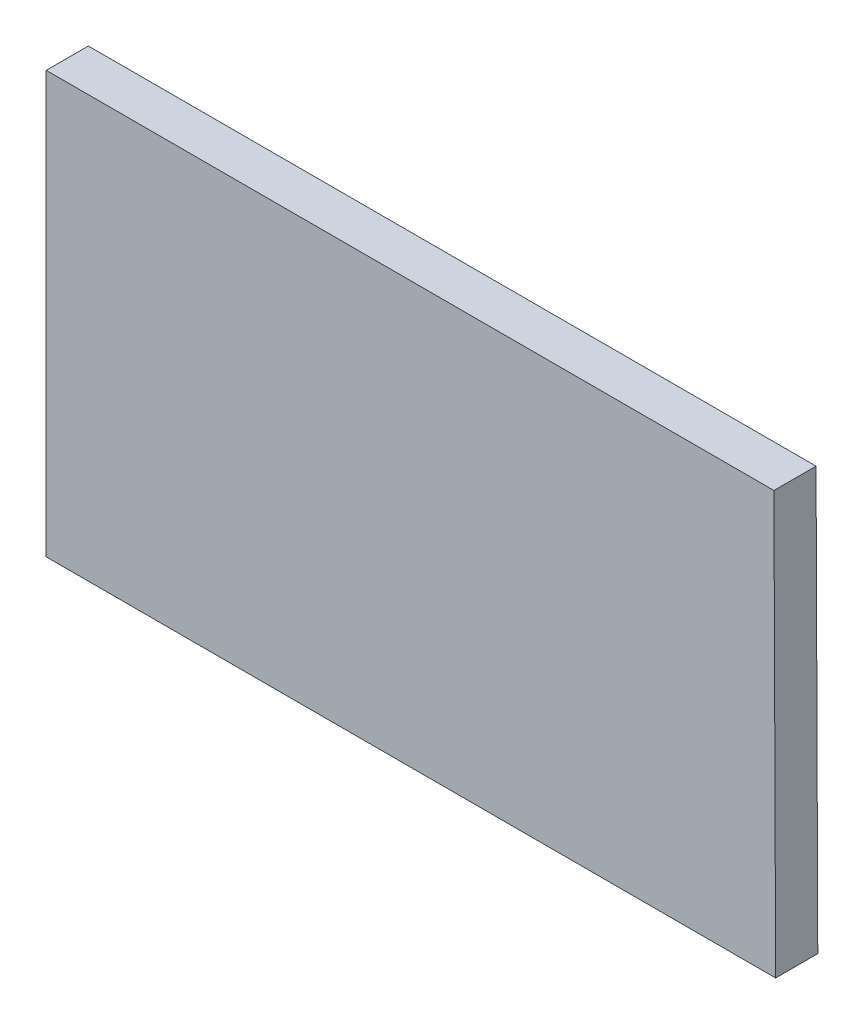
ISO-10303-21;
HEADER;
FILE_DESCRIPTION(('STEP AP214'),'2;1');
FILE_NAME('part.step','',(''),(''),'','','');
FILE_SCHEMA(('AUTOMOTIVE_DESIGN { 1 0 10303 214 1 1 1 1 }'));
ENDSEC;
DATA;
#1=APPLICATION_CONTEXT('core data for automotive mechanical design processes');
#2=APPLICATION_PROTOCOL_DEFINITION('international standard','automotive_design',2000,#1);
#3=PRODUCT_CONTEXT('',#1,'mechanical');
#4=PRODUCT('Part','Part','',(#3));
#5=PRODUCT_RELATED_PRODUCT_CATEGORY('part','',(#4));
#6=PRODUCT_DEFINITION_FORMATION('','',#4);
#7=PRODUCT_DEFINITION_CONTEXT('part definition',#1,'design');
#8=PRODUCT_DEFINITION('design','',#6,#7);
#9=PRODUCT_DEFINITION_SHAPE('','',#8);
#10=(LENGTH_UNIT() NAMED_UNIT(*) SI_UNIT(.MILLI.,.METRE.));
#11=(NAMED_UNIT(*) PLANE_ANGLE_UNIT() SI_UNIT($,.RADIAN.));
#12=(NAMED_UNIT(*) SI_UNIT($,.STERADIAN.) SOLID_ANGLE_UNIT());
#13=UNCERTAINTY_MEASURE_WITH_UNIT(LENGTH_MEASURE(1.E-05),#10,'distance_accuracy_value','');
#14=(GEOMETRIC_REPRESENTATION_CONTEXT(3) GLOBAL_UNCERTAINTY_ASSIGNED_CONTEXT((#13)) GLOBAL_UNIT_ASSIGNED_CONTEXT((#10,
#11,#12)) REPRESENTATION_CONTEXT('',''));
#15=CARTESIAN_POINT('',(0.,0.,0.));
#16=DIRECTION('',(0.,0.,1.));
#17=DIRECTION('',(1.,0.,0.));
#18=AXIS2_PLACEMENT_3D('',#15,#16,#17);
#19=CARTESIAN_POINT('',(-17.3115998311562,10.,2.));
#20=DIRECTION('',(1.,0.,0.));
#21=DIRECTION('',(0.,0.,-1.));
#22=AXIS2_PLACEMENT_3D('',#19,#20,#21);
#23=PLANE('',#22);
#24=DIRECTION('',(0.,-1.,0.));
#25=VECTOR('',#24,1.);
#26=CARTESIAN_POINT('',(-17.3115998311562,10.,0.));
#27=LINE('',#26,#25);
#28=CARTESIAN_POINT('',(-17.3115998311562,10.,0.));
#29=VERTEX_POINT('',#28);
#30=CARTESIAN_POINT('',(-17.3115998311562,-10.,0.));
#31=VERTEX_POINT('',#30);
#32=EDGE_CURVE('E105',#29,#31,#27,.T.);
#33=ORIENTED_EDGE('',*,*,#32,.T.);
#34=DIRECTION('',(0.,0.,-1.));
#35=VECTOR('',#34,1.);
#36=CARTESIAN_POINT('',(-17.3115998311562,-10.,2.));
#37=LINE('',#36,#35);
#38=CARTESIAN_POINT('',(-17.3115998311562,-10.,2.));
#39=VERTEX_POINT('',#38);
#40=EDGE_CURVE('E11',#39,#31,#37,.T.);
#41=ORIENTED_EDGE('',*,*,#40,.F.);
#42=DIRECTION('',(0.,-1.,0.));
#43=VECTOR('',#42,1.);
#44=CARTESIAN_POINT('',(-17.3115998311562,10.,2.));
#45=LINE('',#44,#43);
#46=CARTESIAN_POINT('',(-17.3115998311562,10.,2.));
#47=VERTEX_POINT('',#46);
#48=EDGE_CURVE('E89',#47,#39,#45,.T.);
#49=ORIENTED_EDGE('',*,*,#48,.F.);
#50=DIRECTION('',(0.,0.,-1.));
#51=VECTOR('',#50,1.);
#52=CARTESIAN_POINT('',(-17.3115998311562,10.,2.));
#53=LINE('',#52,#51);
#54=EDGE_CURVE('E101',#47,#29,#53,.T.);
#55=ORIENTED_EDGE('',*,*,#54,.T.);
#56=EDGE_LOOP('',(#33,#41,#49,#55));
#57=FACE_BOUND('',#56,.T.);
#58=ADVANCED_FACE('F36',(#57),#23,.F.);
#59=CARTESIAN_POINT('',(-17.3115998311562,-10.,2.));
#60=DIRECTION('',(0.,1.,0.));
#61=DIRECTION('',(0.,0.,1.));
#62=AXIS2_PLACEMENT_3D('',#59,#60,#61);
#63=PLANE('',#62);
#64=DIRECTION('',(1.,0.,0.));
#65=VECTOR('',#64,1.);
#66=CARTESIAN_POINT('',(-17.3115998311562,-10.,0.));
#67=LINE('',#66,#65);
#68=CARTESIAN_POINT('',(17.3115998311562,-10.,0.));
#69=VERTEX_POINT('',#68);
#70=EDGE_CURVE('E94',#31,#69,#67,.T.);
#71=ORIENTED_EDGE('',*,*,#70,.T.);
#72=DIRECTION('',(0.,0.,-1.));
#73=VECTOR('',#72,1.);
#74=CARTESIAN_POINT('',(17.3115998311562,-10.,2.));
#75=LINE('',#74,#73);
#76=CARTESIAN_POINT('',(17.3115998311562,-10.,2.));
#77=VERTEX_POINT('',#76);
#78=EDGE_CURVE('E44',#77,#69,#75,.T.);
#79=ORIENTED_EDGE('',*,*,#78,.F.);
#80=DIRECTION('',(1.,0.,0.));
#81=VECTOR('',#80,1.);
#82=CARTESIAN_POINT('',(-17.3115998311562,-10.,2.));
#83=LINE('',#82,#81);
#84=EDGE_CURVE('E83',#39,#77,#83,.T.);
#85=ORIENTED_EDGE('',*,*,#84,.F.);
#86=ORIENTED_EDGE('',*,*,#40,.T.);
#87=EDGE_LOOP('',(#71,#79,#85,#86));
#88=FACE_BOUND('',#87,.T.);
#89=ADVANCED_FACE('F93',(#88),#63,.F.);
#90=CARTESIAN_POINT('',(17.3115998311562,-10.,2.));
#91=DIRECTION('',(-0.999991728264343,-0.00406735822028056,0.));
#92=DIRECTION('',(0.00406735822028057,-0.999991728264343,0.));
#93=AXIS2_PLACEMENT_3D('',#90,#91,#92);
#94=PLANE('',#93);
#95=DIRECTION('',(-0.00406735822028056,0.999991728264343,0.));
#96=VECTOR('',#95,1.);
#97=CARTESIAN_POINT('',(17.3115998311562,-10.,0.));
#98=LINE('',#97,#96);
#99=CARTESIAN_POINT('',(17.2302519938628,10.,0.));
#100=VERTEX_POINT('',#99);
#101=EDGE_CURVE('E70',#69,#100,#98,.T.);
#102=ORIENTED_EDGE('',*,*,#101,.T.);
#103=DIRECTION('',(0.,0.,-1.));
#104=VECTOR('',#103,1.);
#105=CARTESIAN_POINT('',(17.2302519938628,10.,2.));
#106=LINE('',#105,#104);
#107=CARTESIAN_POINT('',(17.2302519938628,10.,2.));
#108=VERTEX_POINT('',#107);
#109=EDGE_CURVE('E96',#108,#100,#106,.T.);
#110=ORIENTED_EDGE('',*,*,#109,.F.);
#111=DIRECTION('',(-0.00406735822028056,0.999991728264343,0.));
#112=VECTOR('',#111,1.);
#113=CARTESIAN_POINT('',(17.3115998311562,-10.,2.));
#114=LINE('',#113,#112);
#115=EDGE_CURVE('E87',#77,#108,#114,.T.);
#116=ORIENTED_EDGE('',*,*,#115,.F.);
#117=ORIENTED_EDGE('',*,*,#78,.T.);
#118=EDGE_LOOP('',(#102,#110,#116,#117));
#119=FACE_BOUND('',#118,.T.);
#120=ADVANCED_FACE('F97',(#119),#94,.F.);
#121=CARTESIAN_POINT('',(17.2302519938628,10.,2.));
#122=DIRECTION('',(0.,-1.,0.));
#123=DIRECTION('',(0.,0.,-1.));
#124=AXIS2_PLACEMENT_3D('',#121,#122,#123);
#125=PLANE('',#124);
#126=DIRECTION('',(-1.,0.,0.));
#127=VECTOR('',#126,1.);
#128=CARTESIAN_POINT('',(17.2302519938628,10.,0.));
#129=LINE('',#128,#127);
#130=EDGE_CURVE('E76',#100,#29,#129,.T.);
#131=ORIENTED_EDGE('',*,*,#130,.T.);
#132=ORIENTED_EDGE('',*,*,#54,.F.);
#133=DIRECTION('',(-1.,0.,0.));
#134=VECTOR('',#133,1.);
#135=CARTESIAN_POINT('',(17.2302519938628,10.,2.));
#136=LINE('',#135,#134);
#137=EDGE_CURVE('E52',#108,#47,#136,.T.);
#138=ORIENTED_EDGE('',*,*,#137,.F.);
#139=ORIENTED_EDGE('',*,*,#109,.T.);
#140=EDGE_LOOP('',(#131,#132,#138,#139));
#141=FACE_BOUND('',#140,.T.);
#142=ADVANCED_FACE('F113',(#141),#125,.F.);
#143=CARTESIAN_POINT('',(0.,0.,2.));
#144=DIRECTION('',(0.,0.,1.));
#145=DIRECTION('',(1.,0.,0.));
#146=AXIS2_PLACEMENT_3D('',#143,#144,#145);
#147=PLANE('',#146);
#148=ORIENTED_EDGE('',*,*,#48,.T.);
#149=ORIENTED_EDGE('',*,*,#84,.T.);
#150=ORIENTED_EDGE('',*,*,#115,.T.);
#151=ORIENTED_EDGE('',*,*,#137,.T.);
#152=EDGE_LOOP('',(#148,#149,#150,#151));
#153=FACE_BOUND('',#152,.T.);
#154=ADVANCED_FACE('F85',(#153),#147,.T.);
#155=CARTESIAN_POINT('',(0.,0.,0.));
#156=DIRECTION('',(0.,0.,1.));
#157=DIRECTION('',(1.,0.,0.));
#158=AXIS2_PLACEMENT_3D('',#155,#156,#157);
#159=PLANE('',#158);
#160=ORIENTED_EDGE('',*,*,#32,.F.);
#161=ORIENTED_EDGE('',*,*,#130,.F.);
#162=ORIENTED_EDGE('',*,*,#101,.F.);
#163=ORIENTED_EDGE('',*,*,#70,.F.);
#164=EDGE_LOOP('',(#160,#161,#162,#163));
#165=FACE_BOUND('',#164,.T.);
#166=ADVANCED_FACE('F116',(#165),#159,.F.);
#167=CLOSED_SHELL('',(#58,#89,#120,#142,#154,#166));
#168=MANIFOLD_SOLID_BREP('B2',#167);
#169=ADVANCED_BREP_SHAPE_REPRESENTATION('',(#18,#168),#14);
#170=SHAPE_DEFINITION_REPRESENTATION(#9,#169);
ENDSEC;
END-ISO-10303-21;
